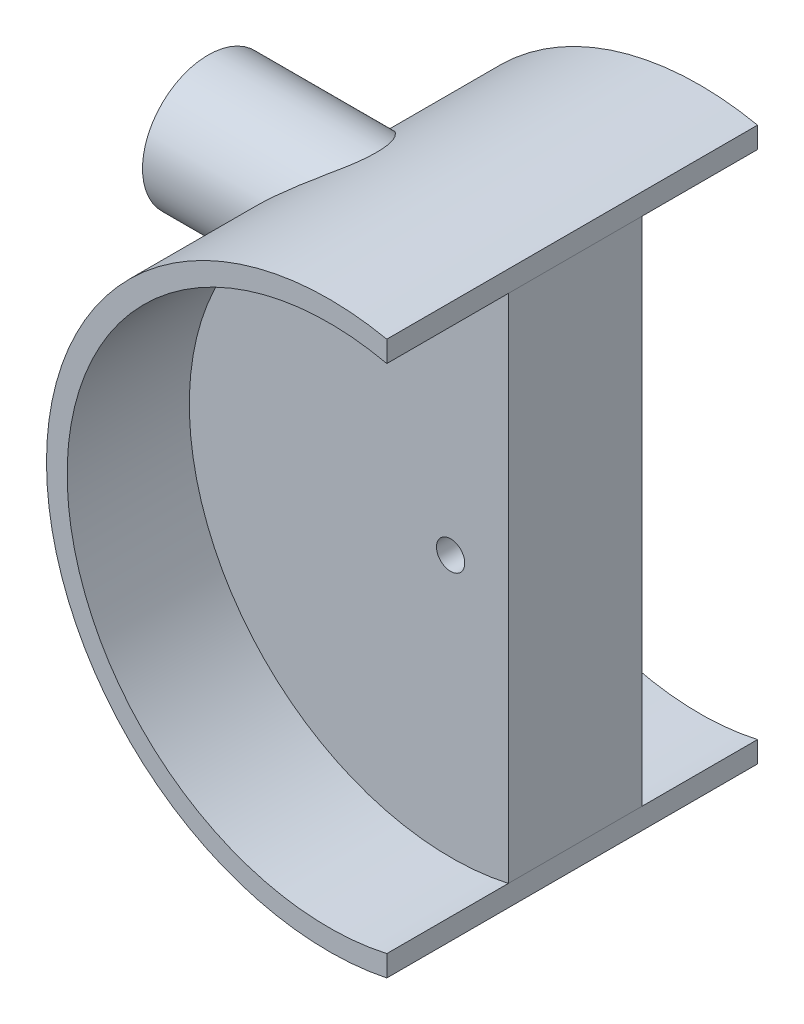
ISO-10303-21;
HEADER;
FILE_DESCRIPTION(('STEP AP214'),'2;1');
FILE_NAME('part.step','',(''),(''),'','','');
FILE_SCHEMA(('AUTOMOTIVE_DESIGN { 1 0 10303 214 1 1 1 1 }'));
ENDSEC;
DATA;
#1=APPLICATION_CONTEXT('core data for automotive mechanical design processes');
#2=APPLICATION_PROTOCOL_DEFINITION('international standard','automotive_design',2000,#1);
#3=PRODUCT_CONTEXT('',#1,'mechanical');
#4=PRODUCT('Part','Part','',(#3));
#5=PRODUCT_RELATED_PRODUCT_CATEGORY('part','',(#4));
#6=PRODUCT_DEFINITION_FORMATION('','',#4);
#7=PRODUCT_DEFINITION_CONTEXT('part definition',#1,'design');
#8=PRODUCT_DEFINITION('design','',#6,#7);
#9=PRODUCT_DEFINITION_SHAPE('','',#8);
#10=(LENGTH_UNIT() NAMED_UNIT(*) SI_UNIT(.MILLI.,.METRE.));
#11=(NAMED_UNIT(*) PLANE_ANGLE_UNIT() SI_UNIT($,.RADIAN.));
#12=(NAMED_UNIT(*) SI_UNIT($,.STERADIAN.) SOLID_ANGLE_UNIT());
#13=UNCERTAINTY_MEASURE_WITH_UNIT(LENGTH_MEASURE(1.E-05),#10,'distance_accuracy_value','');
#14=(GEOMETRIC_REPRESENTATION_CONTEXT(3) GLOBAL_UNCERTAINTY_ASSIGNED_CONTEXT((#13)) GLOBAL_UNIT_ASSIGNED_CONTEXT((#10,
#11,#12)) REPRESENTATION_CONTEXT('',''));
#15=CARTESIAN_POINT('',(0.,0.,0.));
#16=DIRECTION('',(0.,0.,1.));
#17=DIRECTION('',(1.,0.,0.));
#18=AXIS2_PLACEMENT_3D('',#15,#16,#17);
#19=CARTESIAN_POINT('',(-32.3215,18.7447089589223,19.05));
#20=DIRECTION('',(1.,0.,0.));
#21=DIRECTION('',(0.,0.,-1.));
#22=AXIS2_PLACEMENT_3D('',#19,#20,#21);
#23=CYLINDRICAL_SURFACE('',#22,6.858);
#24=CARTESIAN_POINT('',(-32.3215,18.7447089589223,19.05));
#25=DIRECTION('',(1.,0.,0.));
#26=DIRECTION('',(0.,0.,-1.));
#27=AXIS2_PLACEMENT_3D('',#24,#25,#26);
#28=CIRCLE('',#27,6.858);
#29=CARTESIAN_POINT('',(-32.3215,18.7447089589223,12.192));
#30=VERTEX_POINT('',#29);
#31=EDGE_CURVE('E12',#30,#30,#28,.T.);
#32=CARTESIAN_POINT('',(6.03249999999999,18.7447089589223,19.05));
#33=DIRECTION('',(1.,0.,0.));
#34=DIRECTION('',(0.,0.,-1.));
#35=AXIS2_PLACEMENT_3D('',#32,#33,#34);
#36=CIRCLE('',#35,6.858);
#37=CARTESIAN_POINT('',(6.03249999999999,18.7447089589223,12.192));
#38=VERTEX_POINT('',#37);
#39=EDGE_CURVE('E47',#38,#38,#36,.T.);
#40=CARTESIAN_POINT('',(-32.3215,18.7447089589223,12.192));
#41=CARTESIAN_POINT('',(-31.9219791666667,18.7447089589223,12.192));
#42=CARTESIAN_POINT('',(-31.5224583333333,18.7447089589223,12.192));
#43=CARTESIAN_POINT('',(-30.7234166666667,18.7447089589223,12.192));
#44=CARTESIAN_POINT('',(-30.3238958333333,18.7447089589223,12.192));
#45=CARTESIAN_POINT('',(-29.5248541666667,18.7447089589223,12.192));
#46=CARTESIAN_POINT('',(-29.1253333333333,18.7447089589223,12.192));
#47=CARTESIAN_POINT('',(-28.3262916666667,18.7447089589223,12.192));
#48=CARTESIAN_POINT('',(-27.9267708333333,18.7447089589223,12.192));
#49=CARTESIAN_POINT('',(-27.1277291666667,18.7447089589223,12.192));
#50=CARTESIAN_POINT('',(-26.7282083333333,18.7447089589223,12.192));
#51=CARTESIAN_POINT('',(-25.9291666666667,18.7447089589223,12.192));
#52=CARTESIAN_POINT('',(-25.5296458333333,18.7447089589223,12.192));
#53=CARTESIAN_POINT('',(-24.7306041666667,18.7447089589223,12.192));
#54=CARTESIAN_POINT('',(-24.3310833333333,18.7447089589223,12.192));
#55=CARTESIAN_POINT('',(-23.5320416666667,18.7447089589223,12.192));
#56=CARTESIAN_POINT('',(-23.1325208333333,18.7447089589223,12.192));
#57=CARTESIAN_POINT('',(-22.3334791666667,18.7447089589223,12.192));
#58=CARTESIAN_POINT('',(-21.9339583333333,18.7447089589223,12.192));
#59=CARTESIAN_POINT('',(-21.1349166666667,18.7447089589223,12.192));
#60=CARTESIAN_POINT('',(-20.7353958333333,18.7447089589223,12.192));
#61=CARTESIAN_POINT('',(-19.9363541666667,18.7447089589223,12.192));
#62=CARTESIAN_POINT('',(-19.5368333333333,18.7447089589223,12.192));
#63=CARTESIAN_POINT('',(-18.7377916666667,18.7447089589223,12.192));
#64=CARTESIAN_POINT('',(-18.3382708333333,18.7447089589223,12.192));
#65=CARTESIAN_POINT('',(-17.5392291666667,18.7447089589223,12.192));
#66=CARTESIAN_POINT('',(-17.1397083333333,18.7447089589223,12.192));
#67=CARTESIAN_POINT('',(-16.3406666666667,18.7447089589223,12.192));
#68=CARTESIAN_POINT('',(-15.9411458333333,18.7447089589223,12.192));
#69=CARTESIAN_POINT('',(-15.1421041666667,18.7447089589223,12.192));
#70=CARTESIAN_POINT('',(-14.7425833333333,18.7447089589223,12.192));
#71=CARTESIAN_POINT('',(-13.9435416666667,18.7447089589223,12.192));
#72=CARTESIAN_POINT('',(-13.5440208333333,18.7447089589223,12.192));
#73=CARTESIAN_POINT('',(-12.7449791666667,18.7447089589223,12.192));
#74=CARTESIAN_POINT('',(-12.3454583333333,18.7447089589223,12.192));
#75=CARTESIAN_POINT('',(-11.5464166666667,18.7447089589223,12.192));
#76=CARTESIAN_POINT('',(-11.1468958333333,18.7447089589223,12.192));
#77=CARTESIAN_POINT('',(-10.3478541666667,18.7447089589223,12.192));
#78=CARTESIAN_POINT('',(-9.94833333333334,18.7447089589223,12.192));
#79=CARTESIAN_POINT('',(-9.14929166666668,18.7447089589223,12.192));
#80=CARTESIAN_POINT('',(-8.74977083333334,18.7447089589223,12.192));
#81=CARTESIAN_POINT('',(-7.95072916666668,18.7447089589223,12.192));
#82=CARTESIAN_POINT('',(-7.55120833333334,18.7447089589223,12.192));
#83=CARTESIAN_POINT('',(-6.75216666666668,18.7447089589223,12.192));
#84=CARTESIAN_POINT('',(-6.35264583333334,18.7447089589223,12.192));
#85=CARTESIAN_POINT('',(-5.55360416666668,18.7447089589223,12.192));
#86=CARTESIAN_POINT('',(-5.15408333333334,18.7447089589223,12.192));
#87=CARTESIAN_POINT('',(-4.35504166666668,18.7447089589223,12.192));
#88=CARTESIAN_POINT('',(-3.95552083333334,18.7447089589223,12.192));
#89=CARTESIAN_POINT('',(-3.15647916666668,18.7447089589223,12.192));
#90=CARTESIAN_POINT('',(-2.75695833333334,18.7447089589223,12.192));
#91=CARTESIAN_POINT('',(-1.95791666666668,18.7447089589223,12.192));
#92=CARTESIAN_POINT('',(-1.55839583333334,18.7447089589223,12.192));
#93=CARTESIAN_POINT('',(-0.759354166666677,18.7447089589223,12.192));
#94=CARTESIAN_POINT('',(-0.359833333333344,18.7447089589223,12.192));
#95=CARTESIAN_POINT('',(0.439208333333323,18.7447089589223,12.192));
#96=CARTESIAN_POINT('',(0.838729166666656,18.7447089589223,12.192));
#97=CARTESIAN_POINT('',(1.63777083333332,18.7447089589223,12.192));
#98=CARTESIAN_POINT('',(2.03729166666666,18.7447089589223,12.192));
#99=CARTESIAN_POINT('',(2.83633333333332,18.7447089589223,12.192));
#100=CARTESIAN_POINT('',(3.23585416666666,18.7447089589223,12.192));
#101=CARTESIAN_POINT('',(4.03489583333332,18.7447089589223,12.192));
#102=CARTESIAN_POINT('',(4.43441666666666,18.7447089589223,12.192));
#103=CARTESIAN_POINT('',(5.23345833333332,18.7447089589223,12.192));
#104=CARTESIAN_POINT('',(5.63297916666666,18.7447089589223,12.192));
#105=CARTESIAN_POINT('',(6.03249999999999,18.7447089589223,12.192));
#106=B_SPLINE_CURVE_WITH_KNOTS('',3,(#40,#41,#42,#43,#44,#45,#46,#47,#48,#49,#50,#51,#52,#53,
#54,#55,#56,#57,#58,#59,#60,#61,#62,#63,#64,#65,#66,#67,#68,#69,#70,#71,#72,#73,#74,#75,#76,#77,
#78,#79,#80,#81,#82,#83,#84,#85,#86,#87,#88,#89,#90,#91,#92,#93,#94,#95,#96,#97,#98,#99,#100,
#101,#102,#103,#104,#105),.UNSPECIFIED.,.F.,.F.,(4,2,2,2,2,2,2,2,2,2,2,2,2,2,2,2,2,2,2,2,2,2,2,
2,2,2,2,2,2,2,2,2,4),(0.,1.1985625,2.397125,3.5956875,4.79425,5.9928125,7.191375,
8.38993749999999,9.58849999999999,10.7870625,11.985625,13.1841875,14.38275,15.5813125,16.779875,
17.9784375,19.177,20.3755625,21.574125,22.7726875,23.97125,25.1698125,26.368375,27.5669375,
28.7655,29.9640625,31.162625,32.3611875,33.55975,34.7583125,35.956875,37.1554375,38.354),.UNSPECIFIED.);
#107=EDGE_CURVE('BSEAM44',#30,#38,#106,.T.);
#108=ORIENTED_EDGE('',*,*,#31,.T.);
#109=ORIENTED_EDGE('',*,*,#39,.F.);
#110=ORIENTED_EDGE('',*,*,#107,.T.);
#111=ORIENTED_EDGE('',*,*,#107,.F.);
#112=EDGE_LOOP('',(#108,#110,#109,#111));
#113=FACE_BOUND('',#112,.T.);
#114=ADVANCED_FACE('F44',(#113),#23,.T.);
#115=CARTESIAN_POINT('',(-32.3215,18.7447089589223,19.05));
#116=DIRECTION('',(1.,0.,0.));
#117=DIRECTION('',(0.,0.,-1.));
#118=AXIS2_PLACEMENT_3D('',#115,#116,#117);
#119=PLANE('',#118);
#120=CARTESIAN_POINT('',(-32.3215,18.7447089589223,19.05));
#121=DIRECTION('',(-1.,0.,0.));
#122=DIRECTION('',(0.,0.,1.));
#123=AXIS2_PLACEMENT_3D('',#120,#121,#122);
#124=CIRCLE('',#123,3.4925);
#125=CARTESIAN_POINT('',(-32.3215,18.7447089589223,22.5425));
#126=VERTEX_POINT('',#125);
#127=EDGE_CURVE('E56',#126,#126,#124,.T.);
#128=ORIENTED_EDGE('',*,*,#127,.F.);
#129=EDGE_LOOP('',(#128));
#130=FACE_BOUND('',#129,.T.);
#131=ORIENTED_EDGE('',*,*,#31,.F.);
#132=EDGE_LOOP('',(#131));
#133=FACE_BOUND('',#132,.T.);
#134=ADVANCED_FACE('F71',(#130,#133),#119,.F.);
#135=CARTESIAN_POINT('',(6.03249999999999,18.7447089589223,19.05));
#136=DIRECTION('',(1.,0.,0.));
#137=DIRECTION('',(0.,0.,-1.));
#138=AXIS2_PLACEMENT_3D('',#135,#136,#137);
#139=PLANE('',#138);
#140=ORIENTED_EDGE('',*,*,#39,.T.);
#141=EDGE_LOOP('',(#140));
#142=FACE_BOUND('',#141,.T.);
#143=ADVANCED_FACE('F67',(#142),#139,.T.);
#144=CARTESIAN_POINT('',(-13.0175,18.7447089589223,19.05));
#145=DIRECTION('',(-1.,0.,0.));
#146=DIRECTION('',(0.,0.,1.));
#147=AXIS2_PLACEMENT_3D('',#144,#145,#146);
#148=CYLINDRICAL_SURFACE('',#147,3.4925);
#149=CARTESIAN_POINT('',(-13.0175,18.7447089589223,19.05));
#150=DIRECTION('',(-1.,0.,0.));
#151=DIRECTION('',(0.,0.,1.));
#152=AXIS2_PLACEMENT_3D('',#149,#150,#151);
#153=CIRCLE('',#152,3.4925);
#154=CARTESIAN_POINT('',(-13.0175,18.7447089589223,22.5425));
#155=VERTEX_POINT('',#154);
#156=EDGE_CURVE('E54',#155,#155,#153,.T.);
#157=ORIENTED_EDGE('',*,*,#156,.F.);
#158=EDGE_LOOP('',(#157));
#159=FACE_BOUND('',#158,.T.);
#160=ORIENTED_EDGE('',*,*,#127,.T.);
#161=EDGE_LOOP('',(#160));
#162=FACE_BOUND('',#161,.T.);
#163=ADVANCED_FACE('F64',(#159,#162),#148,.F.);
#164=CARTESIAN_POINT('',(-13.0175,18.7447089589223,19.05));
#165=DIRECTION('',(-1.,0.,0.));
#166=DIRECTION('',(0.,0.,1.));
#167=AXIS2_PLACEMENT_3D('',#164,#165,#166);
#168=PLANE('',#167);
#169=ORIENTED_EDGE('',*,*,#156,.T.);
#170=EDGE_LOOP('',(#169));
#171=FACE_BOUND('',#170,.T.);
#172=ADVANCED_FACE('F62',(#171),#168,.T.);
#173=CLOSED_SHELL('',(#114,#134,#143,#163,#172));
#174=MANIFOLD_SOLID_BREP('B2',#173);
#175=CARTESIAN_POINT('',(0.,0.,12.065));
#176=DIRECTION('',(0.,0.,-1.));
#177=DIRECTION('',(-1.,0.,0.));
#178=AXIS2_PLACEMENT_3D('',#175,#176,#177);
#179=PLANE('',#178);
#180=CARTESIAN_POINT('',(0.,0.,12.065));
#181=DIRECTION('',(0.,0.,-1.));
#182=DIRECTION('',(-1.,0.,0.));
#183=AXIS2_PLACEMENT_3D('',#180,#181,#182);
#184=CIRCLE('',#183,1.47623246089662);
#185=CARTESIAN_POINT('',(-1.47623246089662,0.,12.065));
#186=VERTEX_POINT('',#185);
#187=EDGE_CURVE('E164',#186,#186,#184,.T.);
#188=ORIENTED_EDGE('',*,*,#187,.F.);
#189=EDGE_LOOP('',(#188));
#190=FACE_BOUND('',#189,.T.);
#191=DIRECTION('',(0.,1.,0.));
#192=VECTOR('',#191,1.);
#193=CARTESIAN_POINT('',(6.03249999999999,26.6953879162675,12.065));
#194=LINE('',#193,#192);
#195=CARTESIAN_POINT('',(6.03249999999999,-26.6953879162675,12.065));
#196=VERTEX_POINT('',#195);
#197=CARTESIAN_POINT('',(6.03249999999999,26.6953879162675,12.065));
#198=VERTEX_POINT('',#197);
#199=EDGE_CURVE('E152',#196,#198,#194,.T.);
#200=ORIENTED_EDGE('',*,*,#199,.F.);
#201=CARTESIAN_POINT('',(0.0540186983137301,0.,12.065));
#202=DIRECTION('',(0.,0.,1.));
#203=DIRECTION('',(1.,0.,0.));
#204=AXIS2_PLACEMENT_3D('',#201,#202,#203);
#205=CIRCLE('',#204,27.3566440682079);
#206=EDGE_CURVE('E136',#198,#196,#205,.T.);
#207=ORIENTED_EDGE('',*,*,#206,.F.);
#208=EDGE_LOOP('',(#200,#207));
#209=FACE_BOUND('',#208,.T.);
#210=ADVANCED_FACE('F123',(#190,#209),#179,.T.);
#211=CARTESIAN_POINT('',(0.,0.,26.035));
#212=DIRECTION('',(0.,0.,-1.));
#213=DIRECTION('',(-1.,0.,0.));
#214=AXIS2_PLACEMENT_3D('',#211,#212,#213);
#215=PLANE('',#214);
#216=CARTESIAN_POINT('',(0.,0.,26.035));
#217=DIRECTION('',(0.,0.,1.));
#218=DIRECTION('',(1.,0.,0.));
#219=AXIS2_PLACEMENT_3D('',#216,#217,#218);
#220=CIRCLE('',#219,1.47623246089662);
#221=CARTESIAN_POINT('',(1.47623246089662,0.,26.035));
#222=VERTEX_POINT('',#221);
#223=EDGE_CURVE('E167',#222,#222,#220,.T.);
#224=ORIENTED_EDGE('',*,*,#223,.F.);
#225=EDGE_LOOP('',(#224));
#226=FACE_BOUND('',#225,.T.);
#227=DIRECTION('',(0.,1.,0.));
#228=VECTOR('',#227,1.);
#229=CARTESIAN_POINT('',(6.03249999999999,26.6953879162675,26.035));
#230=LINE('',#229,#228);
#231=CARTESIAN_POINT('',(6.03249999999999,-26.6953879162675,26.035));
#232=VERTEX_POINT('',#231);
#233=CARTESIAN_POINT('',(6.03249999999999,26.6953879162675,26.035));
#234=VERTEX_POINT('',#233);
#235=EDGE_CURVE('E145',#232,#234,#230,.T.);
#236=ORIENTED_EDGE('',*,*,#235,.T.);
#237=CARTESIAN_POINT('',(0.0540186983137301,0.,26.035));
#238=DIRECTION('',(0.,0.,1.));
#239=DIRECTION('',(1.,0.,0.));
#240=AXIS2_PLACEMENT_3D('',#237,#238,#239);
#241=CIRCLE('',#240,27.3566440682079);
#242=EDGE_CURVE('E42',#234,#232,#241,.T.);
#243=ORIENTED_EDGE('',*,*,#242,.T.);
#244=EDGE_LOOP('',(#236,#243));
#245=FACE_BOUND('',#244,.T.);
#246=ADVANCED_FACE('F210',(#226,#245),#215,.F.);
#247=CARTESIAN_POINT('',(6.03249999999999,26.6953879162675,26.035));
#248=DIRECTION('',(-1.,0.,0.));
#249=DIRECTION('',(0.,0.,1.));
#250=AXIS2_PLACEMENT_3D('',#247,#248,#249);
#251=PLANE('',#250);
#252=ORIENTED_EDGE('',*,*,#199,.T.);
#253=DIRECTION('',(0.,0.,-1.));
#254=VECTOR('',#253,1.);
#255=CARTESIAN_POINT('',(6.03249999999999,26.6953879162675,26.035));
#256=LINE('',#255,#254);
#257=EDGE_CURVE('E159',#234,#198,#256,.T.);
#258=ORIENTED_EDGE('',*,*,#257,.F.);
#259=ORIENTED_EDGE('',*,*,#235,.F.);
#260=DIRECTION('',(0.,0.,-1.));
#261=VECTOR('',#260,1.);
#262=CARTESIAN_POINT('',(6.03249999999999,-26.6953879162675,26.035));
#263=LINE('',#262,#261);
#264=EDGE_CURVE('E158',#232,#196,#263,.T.);
#265=ORIENTED_EDGE('',*,*,#264,.T.);
#266=EDGE_LOOP('',(#252,#258,#259,#265));
#267=FACE_BOUND('',#266,.T.);
#268=ADVANCED_FACE('F162',(#267),#251,.F.);
#269=CARTESIAN_POINT('',(0.0540186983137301,0.,26.035));
#270=DIRECTION('',(0.,0.,-1.));
#271=DIRECTION('',(-1.,0.,0.));
#272=AXIS2_PLACEMENT_3D('',#269,#270,#271);
#273=CYLINDRICAL_SURFACE('',#272,27.3566440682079);
#274=CARTESIAN_POINT('',(-19.8713887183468,18.7447089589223,22.5425));
#275=CARTESIAN_POINT('',(-20.073689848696,18.5296579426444,22.5425032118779));
#276=CARTESIAN_POINT('',(-20.272640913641,18.3111595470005,22.5226804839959));
#277=CARTESIAN_POINT('',(-20.6595476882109,17.8723138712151,22.4391511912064));
#278=CARTESIAN_POINT('',(-20.8474995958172,17.6519659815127,22.3754295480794));
#279=CARTESIAN_POINT('',(-21.1748921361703,17.2561036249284,22.2152278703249));
#280=CARTESIAN_POINT('',(-21.3169955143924,17.0796216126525,22.1266491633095));
#281=CARTESIAN_POINT('',(-21.5865574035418,16.7367501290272,21.9146433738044));
#282=CARTESIAN_POINT('',(-21.7140367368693,16.5703464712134,21.7912667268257));
#283=CARTESIAN_POINT('',(-21.9297606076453,16.2826896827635,21.5332489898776));
#284=CARTESIAN_POINT('',(-22.0209733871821,16.1586160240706,21.4042931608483));
#285=CARTESIAN_POINT('',(-22.1461839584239,15.9856837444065,21.1932775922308));
#286=CARTESIAN_POINT('',(-22.186002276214,15.93021269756,21.1199695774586));
#287=CARTESIAN_POINT('',(-22.2614362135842,15.8243691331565,20.9677465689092));
#288=CARTESIAN_POINT('',(-22.2970536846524,15.7739943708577,20.8888340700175));
#289=CARTESIAN_POINT('',(-22.3640222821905,15.6786746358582,20.7251221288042));
#290=CARTESIAN_POINT('',(-22.3953374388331,15.6337757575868,20.6402810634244));
#291=CARTESIAN_POINT('',(-22.4530252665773,15.5506111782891,20.4658475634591));
#292=CARTESIAN_POINT('',(-22.4794004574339,15.5123420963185,20.3762575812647));
#293=CARTESIAN_POINT('',(-22.5269204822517,15.4430866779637,20.192995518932));
#294=CARTESIAN_POINT('',(-22.5480669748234,15.4120980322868,20.0993247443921));
#295=CARTESIAN_POINT('',(-22.5848819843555,15.3579694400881,19.908698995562));
#296=CARTESIAN_POINT('',(-22.6005513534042,15.3348282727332,19.8117445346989));
#297=CARTESIAN_POINT('',(-22.6245548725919,15.2993029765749,19.6281942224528));
#298=CARTESIAN_POINT('',(-22.6335756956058,15.285914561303,19.5418808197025));
#299=CARTESIAN_POINT('',(-22.6472313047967,15.2656271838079,19.368118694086));
#300=CARTESIAN_POINT('',(-22.6518646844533,15.2587303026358,19.280669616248));
#301=CARTESIAN_POINT('',(-22.6566885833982,15.2515497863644,19.1054425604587));
#302=CARTESIAN_POINT('',(-22.6568826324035,15.2512608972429,19.0176648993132));
#303=CARTESIAN_POINT('',(-22.6528402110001,15.2572781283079,18.8424290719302));
#304=CARTESIAN_POINT('',(-22.6486021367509,15.2635866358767,18.7549710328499));
#305=CARTESIAN_POINT('',(-22.6301432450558,15.2910204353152,18.505818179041));
#306=CARTESIAN_POINT('',(-22.6104594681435,15.3202404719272,18.3453154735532));
#307=CARTESIAN_POINT('',(-22.5564429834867,15.3998461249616,18.0323667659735));
#308=CARTESIAN_POINT('',(-22.5221102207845,15.4502318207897,17.8799207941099));
#309=CARTESIAN_POINT('',(-22.4387482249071,15.5713498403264,17.5824026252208));
#310=CARTESIAN_POINT('',(-22.389337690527,15.6426078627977,17.4376523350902));
#311=CARTESIAN_POINT('',(-22.2776849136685,15.8015951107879,17.1629761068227));
#312=CARTESIAN_POINT('',(-22.2154388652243,15.8893292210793,17.0330545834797));
#313=CARTESIAN_POINT('',(-22.0725134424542,16.0878522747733,16.7767544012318));
#314=CARTESIAN_POINT('',(-21.9905797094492,16.200099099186,16.6522100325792));
#315=CARTESIAN_POINT('',(-21.8151263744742,16.436184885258,16.4241144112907));
#316=CARTESIAN_POINT('',(-21.7215992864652,16.5600313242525,16.3205768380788));
#317=CARTESIAN_POINT('',(-21.4819700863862,16.8712921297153,16.0937540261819));
#318=CARTESIAN_POINT('',(-21.3307332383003,17.0628658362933,15.9815624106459));
#319=CARTESIAN_POINT('',(-21.0133539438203,17.453232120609,15.7978684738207));
#320=CARTESIAN_POINT('',(-20.8471832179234,17.6520379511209,15.7264453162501));
#321=CARTESIAN_POINT('',(-20.5660761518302,17.9784903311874,15.6400383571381));
#322=CARTESIAN_POINT('',(-20.4542039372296,18.1060176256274,15.6139948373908));
#323=CARTESIAN_POINT('',(-20.227017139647,18.360135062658,15.5763631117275));
#324=CARTESIAN_POINT('',(-20.1117027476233,18.4867252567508,15.5647741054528));
#325=CARTESIAN_POINT('',(-19.8783753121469,18.7380653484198,15.5552404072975));
#326=CARTESIAN_POINT('',(-19.7603601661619,18.8628136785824,15.5573067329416));
#327=CARTESIAN_POINT('',(-19.5224743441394,19.1095856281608,15.5744112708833));
#328=CARTESIAN_POINT('',(-19.402603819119,19.2316094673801,15.589448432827));
#329=CARTESIAN_POINT('',(-19.1598725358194,19.47414296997,15.6322698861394));
#330=CARTESIAN_POINT('',(-19.0369940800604,19.5946009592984,15.6602455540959));
#331=CARTESIAN_POINT('',(-18.7907940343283,19.8314949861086,15.7286067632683));
#332=CARTESIAN_POINT('',(-18.6674724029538,19.947930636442,15.7689934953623));
#333=CARTESIAN_POINT('',(-18.4212099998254,20.1762258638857,15.8619743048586));
#334=CARTESIAN_POINT('',(-18.2982692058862,20.2880857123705,15.9145676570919));
#335=CARTESIAN_POINT('',(-18.05369342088,20.5066724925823,16.0319820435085));
#336=CARTESIAN_POINT('',(-17.9320581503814,20.6134005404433,16.0968004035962));
#337=CARTESIAN_POINT('',(-17.7162490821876,20.7995056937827,16.2241728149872));
#338=CARTESIAN_POINT('',(-17.6216224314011,20.879956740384,16.2843970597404));
#339=CARTESIAN_POINT('',(-17.4345761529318,21.0368705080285,16.4129858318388));
#340=CARTESIAN_POINT('',(-17.342156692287,21.1133329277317,16.4813509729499));
#341=CARTESIAN_POINT('',(-17.1605609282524,21.2616542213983,16.6265113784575));
#342=CARTESIAN_POINT('',(-17.071380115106,21.3335196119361,16.7032942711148));
#343=CARTESIAN_POINT('',(-16.897352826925,21.4720597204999,16.8658500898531));
#344=CARTESIAN_POINT('',(-16.8125043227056,21.5387368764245,16.9516187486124));
#345=CARTESIAN_POINT('',(-16.6267362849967,21.6830722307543,17.1570401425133));
#346=CARTESIAN_POINT('',(-16.5275807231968,21.7589038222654,17.2796230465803));
#347=CARTESIAN_POINT('',(-16.3433592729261,21.8980652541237,17.5414231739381));
#348=CARTESIAN_POINT('',(-16.2582724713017,21.9614136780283,17.680615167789));
#349=CARTESIAN_POINT('',(-16.1263650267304,22.0587001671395,17.9411564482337));
#350=CARTESIAN_POINT('',(-16.0752504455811,22.0960513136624,18.0590205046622));
#351=CARTESIAN_POINT('',(-15.9889125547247,22.1588175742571,18.3034817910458));
#352=CARTESIAN_POINT('',(-15.9536719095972,22.1842457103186,18.4300693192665));
#353=CARTESIAN_POINT('',(-15.9023949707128,22.2211586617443,18.6904629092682));
#354=CARTESIAN_POINT('',(-15.8865431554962,22.2325095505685,18.8243258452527));
#355=CARTESIAN_POINT('',(-15.8767540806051,22.2395257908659,19.0932489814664));
#356=CARTESIAN_POINT('',(-15.8828061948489,22.2351987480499,19.2283085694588));
#357=CARTESIAN_POINT('',(-15.913651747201,22.2130531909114,19.4759862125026));
#358=CARTESIAN_POINT('',(-15.935755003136,22.1971707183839,19.5891373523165));
#359=CARTESIAN_POINT('',(-15.9936034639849,22.1553846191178,19.8099276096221));
#360=CARTESIAN_POINT('',(-16.0293560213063,22.1294755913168,19.9175637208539));
#361=CARTESIAN_POINT('',(-16.1309913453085,22.0553154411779,20.1735851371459));
#362=CARTESIAN_POINT('',(-16.2031743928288,22.002266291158,20.31806079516));
#363=CARTESIAN_POINT('',(-16.3642232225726,21.8823534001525,20.5911419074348));
#364=CARTESIAN_POINT('',(-16.4531305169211,21.8154552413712,20.7197065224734));
#365=CARTESIAN_POINT('',(-16.6211237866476,21.687189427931,20.9344919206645));
#366=CARTESIAN_POINT('',(-16.6979827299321,21.6279119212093,21.0237640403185));
#367=CARTESIAN_POINT('',(-16.8568174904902,21.5039470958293,21.1936481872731));
#368=CARTESIAN_POINT('',(-16.9387960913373,21.4392568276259,21.2742554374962));
#369=CARTESIAN_POINT('',(-17.1066541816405,21.3051367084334,21.4274242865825));
#370=CARTESIAN_POINT('',(-17.192540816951,21.2356980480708,21.4999702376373));
#371=CARTESIAN_POINT('',(-17.3670919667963,21.0927385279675,21.637303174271));
#372=CARTESIAN_POINT('',(-17.4557572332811,21.019216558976,21.7020880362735));
#373=CARTESIAN_POINT('',(-17.6733845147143,20.8363396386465,21.8503228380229));
#374=CARTESIAN_POINT('',(-17.8033850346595,20.7250906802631,21.9299285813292));
#375=CARTESIAN_POINT('',(-18.0657639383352,20.4960927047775,22.0746587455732));
#376=CARTESIAN_POINT('',(-18.1981434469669,20.3783405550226,22.1397761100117));
#377=CARTESIAN_POINT('',(-18.4637143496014,20.1373194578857,22.2556256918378));
#378=CARTESIAN_POINT('',(-18.596904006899,20.0140601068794,22.3063818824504));
#379=CARTESIAN_POINT('',(-18.8631644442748,19.7625828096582,22.3935292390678));
#380=CARTESIAN_POINT('',(-18.996235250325,19.6343674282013,22.429927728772));
#381=CARTESIAN_POINT('',(-19.2540009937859,19.3808456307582,22.4863931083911));
#382=CARTESIAN_POINT('',(-19.3787508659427,19.2557727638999,22.5072543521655));
#383=CARTESIAN_POINT('',(-19.6265350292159,19.0024530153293,22.5353070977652));
#384=CARTESIAN_POINT('',(-19.7495692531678,18.8742060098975,22.5424980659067));
#385=CARTESIAN_POINT('',(-19.8713887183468,18.7447089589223,22.5425));
#386=B_SPLINE_CURVE_WITH_KNOTS('',3,(#274,#275,#276,#277,#278,#279,#280,#281,#282,#283,#284,
#285,#286,#287,#288,#289,#290,#291,#292,#293,#294,#295,#296,#297,#298,#299,#300,#301,#302,#303,
#304,#305,#306,#307,#308,#309,#310,#311,#312,#313,#314,#315,#316,#317,#318,#319,#320,#321,#322,
#323,#324,#325,#326,#327,#328,#329,#330,#331,#332,#333,#334,#335,#336,#337,#338,#339,#340,#341,
#342,#343,#344,#345,#346,#347,#348,#349,#350,#351,#352,#353,#354,#355,#356,#357,#358,#359,#360,
#361,#362,#363,#364,#365,#366,#367,#368,#369,#370,#371,#372,#373,#374,#375,#376,#377,#378,#379,
#380,#381,#382,#383,#384,#385),.UNSPECIFIED.,.T.,.F.,(4,2,2,2,2,2,2,2,2,2,2,2,2,2,2,2,2,2,2,2,2,
2,2,2,2,2,2,2,2,2,2,2,2,2,2,2,2,2,2,2,2,2,2,2,2,2,2,2,2,2,2,2,2,2,2,4),(0.,0.885296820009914,
1.77089786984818,2.4980421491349,3.2241378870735,3.82402837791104,4.12426031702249,
4.42435943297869,4.72683199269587,5.0291498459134,5.33137167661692,5.63354646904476,
5.89663190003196,6.15980164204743,6.4227621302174,6.68581780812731,7.1763095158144,
7.66680306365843,8.17090445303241,8.6751555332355,9.2328401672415,9.79088680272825,
10.5924120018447,11.3954883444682,11.9097770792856,12.4240373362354,12.938712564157,
13.4533461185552,13.9758479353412,14.4983999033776,15.0209208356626,15.5433276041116,
15.9571482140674,16.3710000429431,16.7842515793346,17.1973077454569,17.7207370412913,
18.2433811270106,18.6432985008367,19.0427780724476,19.4460297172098,19.8490857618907,
20.1967447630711,20.5445913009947,21.0517190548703,21.5601225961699,21.9552217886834,
22.3505377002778,22.7466080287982,23.1427864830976,23.7081550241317,24.2737983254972,
24.8384917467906,25.4028967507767,25.9359742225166,26.4690725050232),.UNSPECIFIED.);
#387=CARTESIAN_POINT('',(-19.8713887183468,18.7447089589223,22.5425));
#388=VERTEX_POINT('',#387);
#389=EDGE_CURVE('E126',#388,#388,#386,.T.);
#390=ORIENTED_EDGE('',*,*,#389,.T.);
#391=EDGE_LOOP('',(#390));
#392=FACE_BOUND('',#391,.T.);
#393=ORIENTED_EDGE('',*,*,#206,.T.);
#394=ORIENTED_EDGE('',*,*,#264,.F.);
#395=ORIENTED_EDGE('',*,*,#242,.F.);
#396=ORIENTED_EDGE('',*,*,#257,.T.);
#397=EDGE_LOOP('',(#393,#394,#395,#396));
#398=FACE_BOUND('',#397,.T.);
#399=ADVANCED_FACE('F157',(#392,#398),#273,.T.);
#400=CARTESIAN_POINT('',(0.,0.,0.));
#401=DIRECTION('',(0.,0.,1.));
#402=DIRECTION('',(1.,0.,0.));
#403=AXIS2_PLACEMENT_3D('',#400,#401,#402);
#404=CYLINDRICAL_SURFACE('',#403,1.47623246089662);
#405=ORIENTED_EDGE('',*,*,#187,.T.);
#406=EDGE_LOOP('',(#405));
#407=FACE_BOUND('',#406,.T.);
#408=ORIENTED_EDGE('',*,*,#223,.T.);
#409=EDGE_LOOP('',(#408));
#410=FACE_BOUND('',#409,.T.);
#411=ADVANCED_FACE('F196',(#407,#410),#404,.F.);
#412=CARTESIAN_POINT('',(-13.0175,18.7447089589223,19.05));
#413=DIRECTION('',(-1.,0.,0.));
#414=DIRECTION('',(0.,0.,1.));
#415=AXIS2_PLACEMENT_3D('',#412,#413,#414);
#416=CYLINDRICAL_SURFACE('',#415,3.4925);
#417=CARTESIAN_POINT('',(-13.0175,18.7447089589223,19.05));
#418=DIRECTION('',(-1.,0.,0.));
#419=DIRECTION('',(0.,0.,1.));
#420=AXIS2_PLACEMENT_3D('',#417,#418,#419);
#421=CIRCLE('',#420,3.4925);
#422=CARTESIAN_POINT('',(-13.0175,18.7447089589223,22.5425));
#423=VERTEX_POINT('',#422);
#424=EDGE_CURVE('E185',#423,#423,#421,.T.);
#425=ORIENTED_EDGE('',*,*,#424,.F.);
#426=EDGE_LOOP('',(#425));
#427=FACE_BOUND('',#426,.T.);
#428=ORIENTED_EDGE('',*,*,#389,.F.);
#429=EDGE_LOOP('',(#428));
#430=FACE_BOUND('',#429,.T.);
#431=ADVANCED_FACE('F193',(#427,#430),#416,.F.);
#432=CARTESIAN_POINT('',(-13.0175,18.7447089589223,19.05));
#433=DIRECTION('',(-1.,0.,0.));
#434=DIRECTION('',(0.,0.,1.));
#435=AXIS2_PLACEMENT_3D('',#432,#433,#434);
#436=PLANE('',#435);
#437=ORIENTED_EDGE('',*,*,#424,.T.);
#438=EDGE_LOOP('',(#437));
#439=FACE_BOUND('',#438,.T.);
#440=ADVANCED_FACE('F195',(#439),#436,.T.);
#441=CLOSED_SHELL('',(#210,#246,#268,#399,#411,#431,#440));
#442=MANIFOLD_SOLID_BREP('B7',#441);
#443=CARTESIAN_POINT('',(6.03249999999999,28.9047089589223,38.735));
#444=DIRECTION('',(1.,0.,0.));
#445=DIRECTION('',(0.,0.,-1.));
#446=AXIS2_PLACEMENT_3D('',#443,#444,#445);
#447=PLANE('',#446);
#448=DIRECTION('',(0.,-1.,0.));
#449=VECTOR('',#448,1.);
#450=CARTESIAN_POINT('',(6.03249999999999,28.9047089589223,0.));
#451=LINE('',#450,#449);
#452=CARTESIAN_POINT('',(6.0325,28.9047089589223,0.));
#453=VERTEX_POINT('',#452);
#454=CARTESIAN_POINT('',(6.03249999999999,26.6953879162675,0.));
#455=VERTEX_POINT('',#454);
#456=EDGE_CURVE('E332',#453,#455,#451,.T.);
#457=ORIENTED_EDGE('',*,*,#456,.F.);
#458=DIRECTION('',(0.,0.,-1.));
#459=VECTOR('',#458,1.);
#460=CARTESIAN_POINT('',(6.0325,28.9047089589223,38.735));
#461=LINE('',#460,#459);
#462=CARTESIAN_POINT('',(6.0325,28.9047089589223,38.735));
#463=VERTEX_POINT('',#462);
#464=EDGE_CURVE('E121',#463,#453,#461,.T.);
#465=ORIENTED_EDGE('',*,*,#464,.F.);
#466=DIRECTION('',(0.,-1.,0.));
#467=VECTOR('',#466,1.);
#468=CARTESIAN_POINT('',(6.03249999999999,28.9047089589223,38.735));
#469=LINE('',#468,#467);
#470=CARTESIAN_POINT('',(6.03249999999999,26.6953879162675,38.735));
#471=VERTEX_POINT('',#470);
#472=EDGE_CURVE('E325',#463,#471,#469,.T.);
#473=ORIENTED_EDGE('',*,*,#472,.T.);
#474=DIRECTION('',(0.,0.,-1.));
#475=VECTOR('',#474,1.);
#476=CARTESIAN_POINT('',(6.03249999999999,26.6953879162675,38.735));
#477=LINE('',#476,#475);
#478=EDGE_CURVE('E307',#471,#455,#477,.T.);
#479=ORIENTED_EDGE('',*,*,#478,.T.);
#480=EDGE_LOOP('',(#457,#465,#473,#479));
#481=FACE_BOUND('',#480,.T.);
#482=ADVANCED_FACE('F261',(#481),#447,.T.);
#483=CARTESIAN_POINT('',(0.,0.,38.735));
#484=DIRECTION('',(0.,0.,-1.));
#485=DIRECTION('',(-1.,0.,0.));
#486=AXIS2_PLACEMENT_3D('',#483,#484,#485);
#487=CYLINDRICAL_SURFACE('',#486,29.5275);
#488=CARTESIAN_POINT('',(-22.8146694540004,18.7447089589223,22.5425));
#489=CARTESIAN_POINT('',(-23.0026953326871,18.5158501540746,22.5425022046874));
#490=CARTESIAN_POINT('',(-23.187440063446,18.2839195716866,22.5200361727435));
#491=CARTESIAN_POINT('',(-23.5454325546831,17.8205350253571,22.4262841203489));
#492=CARTESIAN_POINT('',(-23.718675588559,17.5890812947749,22.3549781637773));
#493=CARTESIAN_POINT('',(-24.0122730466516,17.185235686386,22.1809603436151));
#494=CARTESIAN_POINT('',(-24.1359573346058,17.0109061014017,22.0883907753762));
#495=CARTESIAN_POINT('',(-24.3695863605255,16.6744802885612,21.8698998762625));
#496=CARTESIAN_POINT('',(-24.4795510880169,16.5123664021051,21.7440279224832));
#497=CARTESIAN_POINT('',(-24.6673350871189,16.2302253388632,21.4803108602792));
#498=CARTESIAN_POINT('',(-24.7475027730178,16.10752564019,21.3470387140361));
#499=CARTESIAN_POINT('',(-24.8567856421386,15.9379428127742,21.130400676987));
#500=CARTESIAN_POINT('',(-24.8913993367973,15.8838034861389,21.0553590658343));
#501=CARTESIAN_POINT('',(-24.95670712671,15.7809925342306,20.9000273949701));
#502=CARTESIAN_POINT('',(-24.9874028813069,15.7323185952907,20.8197395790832));
#503=CARTESIAN_POINT('',(-25.0447984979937,15.6407885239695,20.65382939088));
#504=CARTESIAN_POINT('',(-25.0714721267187,15.5979707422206,20.568176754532));
#505=CARTESIAN_POINT('',(-25.1203368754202,15.5191521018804,20.3926064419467));
#506=CARTESIAN_POINT('',(-25.1425301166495,15.4831480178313,20.3026908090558));
#507=CARTESIAN_POINT('',(-25.1822290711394,15.4184965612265,20.1192625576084));
#508=CARTESIAN_POINT('',(-25.1997355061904,15.3898480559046,20.0257504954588));
#509=CARTESIAN_POINT('',(-25.2298845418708,15.3403723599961,19.835917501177));
#510=CARTESIAN_POINT('',(-25.2425277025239,15.3195442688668,19.7395968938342));
#511=CARTESIAN_POINT('',(-25.2617368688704,15.2878451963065,19.5554007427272));
#512=CARTESIAN_POINT('',(-25.2688067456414,15.2761499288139,19.4677184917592));
#513=CARTESIAN_POINT('',(-25.2789006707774,15.2594407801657,19.2914568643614));
#514=CARTESIAN_POINT('',(-25.281923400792,15.2544290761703,19.2028772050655));
#515=CARTESIAN_POINT('',(-25.2838892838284,15.2511706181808,19.0256063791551));
#516=CARTESIAN_POINT('',(-25.2828353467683,15.2529190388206,18.9369153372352));
#517=CARTESIAN_POINT('',(-25.2766683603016,15.2631359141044,18.7600536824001));
#518=CARTESIAN_POINT('',(-25.2715538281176,15.2716068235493,18.6718832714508));
#519=CARTESIAN_POINT('',(-25.2508683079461,15.3058049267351,18.4178450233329));
#520=CARTESIAN_POINT('',(-25.2300293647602,15.3402012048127,18.2534620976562));
#521=CARTESIAN_POINT('',(-25.1744342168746,15.4312640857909,17.9335984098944));
#522=CARTESIAN_POINT('',(-25.1396776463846,15.487931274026,17.7781178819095));
#523=CARTESIAN_POINT('',(-25.0560381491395,15.6228890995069,17.4751752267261));
#524=CARTESIAN_POINT('',(-25.0067731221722,15.7017616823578,17.3280787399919));
#525=CARTESIAN_POINT('',(-24.8959103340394,15.8769528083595,17.0498505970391));
#526=CARTESIAN_POINT('',(-24.8343088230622,15.9732766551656,16.918723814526));
#527=CARTESIAN_POINT('',(-24.6938386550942,16.1896797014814,16.6625080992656));
#528=CARTESIAN_POINT('',(-24.6138821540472,16.3111496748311,16.539195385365));
#529=CARTESIAN_POINT('',(-24.4429223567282,16.5662431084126,16.3149062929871));
#530=CARTESIAN_POINT('',(-24.3519138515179,16.6998722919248,16.2139405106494));
#531=CARTESIAN_POINT('',(-24.1463129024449,16.9960568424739,16.0208844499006));
#532=CARTESIAN_POINT('',(-24.0302328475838,17.15993766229,15.9324210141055));
#533=CARTESIAN_POINT('',(-23.7885320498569,17.4934712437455,15.7842195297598));
#534=CARTESIAN_POINT('',(-23.6629058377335,17.6631272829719,15.7244980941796));
#535=CARTESIAN_POINT('',(-23.3801027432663,18.0363116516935,15.6236651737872));
#536=CARTESIAN_POINT('',(-23.2214309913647,18.2402182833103,15.5881540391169));
#537=CARTESIAN_POINT('',(-22.8972005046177,18.6456171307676,15.5529729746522));
#538=CARTESIAN_POINT('',(-22.7316369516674,18.8471075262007,15.5533285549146));
#539=CARTESIAN_POINT('',(-22.3653804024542,19.2810233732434,15.5908347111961));
#540=CARTESIAN_POINT('',(-22.163902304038,19.5121968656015,15.6348459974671));
#541=CARTESIAN_POINT('',(-21.7603838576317,19.9612133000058,15.7678411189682));
#542=CARTESIAN_POINT('',(-21.5583431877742,20.1790453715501,15.8568610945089));
#543=CARTESIAN_POINT('',(-21.2676242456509,20.4836324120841,16.0192370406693));
#544=CARTESIAN_POINT('',(-21.1765823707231,20.5777117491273,16.0751417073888));
#545=CARTESIAN_POINT('',(-20.9964201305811,20.7615055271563,16.1965420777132));
#546=CARTESIAN_POINT('',(-20.9072999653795,20.8512195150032,16.2620387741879));
#547=CARTESIAN_POINT('',(-20.7320135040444,21.0255114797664,16.4027327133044));
#548=CARTESIAN_POINT('',(-20.6458434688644,21.1100960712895,16.4779170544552));
#549=CARTESIAN_POINT('',(-20.4774964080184,21.2734377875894,16.638323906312));
#550=CARTESIAN_POINT('',(-20.3953176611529,21.3521974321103,16.7235420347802));
#551=CARTESIAN_POINT('',(-20.2090389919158,21.5288078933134,16.9354388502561));
#552=CARTESIAN_POINT('',(-20.1070716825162,21.6239578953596,17.0663208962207));
#553=CARTESIAN_POINT('',(-19.9175639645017,21.7986349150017,17.3475346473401));
#554=CARTESIAN_POINT('',(-19.830001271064,21.8781861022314,17.4978356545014));
#555=CARTESIAN_POINT('',(-19.6925082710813,22.0019318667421,17.782480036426));
#556=CARTESIAN_POINT('',(-19.6385356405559,22.0500538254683,17.9131414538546));
#557=CARTESIAN_POINT('',(-19.5469799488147,22.1312588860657,18.1846674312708));
#558=CARTESIAN_POINT('',(-19.5093823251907,22.1643553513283,18.3255227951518));
#559=CARTESIAN_POINT('',(-19.4677373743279,22.2009185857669,18.5424067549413));
#560=CARTESIAN_POINT('',(-19.4562955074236,22.2109421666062,18.6160013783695));
#561=CARTESIAN_POINT('',(-19.4387503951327,22.2262993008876,18.7642952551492));
#562=CARTESIAN_POINT('',(-19.4326445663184,22.2316351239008,18.8389939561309));
#563=CARTESIAN_POINT('',(-19.4259587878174,22.2374774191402,18.988815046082));
#564=CARTESIAN_POINT('',(-19.4253778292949,22.2379847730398,19.0639373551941));
#565=CARTESIAN_POINT('',(-19.4297442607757,22.2341695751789,19.2138741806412));
#566=CARTESIAN_POINT('',(-19.4346912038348,22.2298474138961,19.2886887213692));
#567=CARTESIAN_POINT('',(-19.4556969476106,22.2114714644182,19.4927335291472));
#568=CARTESIAN_POINT('',(-19.4772857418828,22.1925688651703,19.6210201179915));
#569=CARTESIAN_POINT('',(-19.5351434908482,22.1416548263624,19.8714090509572));
#570=CARTESIAN_POINT('',(-19.571419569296,22.1096370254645,19.9935083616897));
#571=CARTESIAN_POINT('',(-19.6716086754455,22.0206037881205,20.2725244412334));
#572=CARTESIAN_POINT('',(-19.7407734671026,21.9587336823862,20.4260068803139));
#573=CARTESIAN_POINT('',(-19.8957036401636,21.8184602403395,20.7160480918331));
#574=CARTESIAN_POINT('',(-19.9815031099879,21.7400229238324,20.8525711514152));
#575=CARTESIAN_POINT('',(-20.2034329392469,21.5342945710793,21.1627022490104));
#576=CARTESIAN_POINT('',(-20.3455247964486,21.4003546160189,21.3276524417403));
#577=CARTESIAN_POINT('',(-20.5687773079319,21.1851259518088,21.5505240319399));
#578=CARTESIAN_POINT('',(-20.6450051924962,21.1108717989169,21.6208110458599));
#579=CARTESIAN_POINT('',(-20.8000636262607,20.9581107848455,21.7534483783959));
#580=CARTESIAN_POINT('',(-20.8788934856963,20.8796050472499,21.8158007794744));
#581=CARTESIAN_POINT('',(-21.0626279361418,20.6944610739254,21.9504840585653));
#582=CARTESIAN_POINT('',(-21.1681941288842,20.5865077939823,22.0201116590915));
#583=CARTESIAN_POINT('',(-21.3812621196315,20.3651319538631,22.1464561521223));
#584=CARTESIAN_POINT('',(-21.4887646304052,20.251707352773,22.2031681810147));
#585=CARTESIAN_POINT('',(-21.8122176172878,19.9047636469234,22.3538301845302));
#586=CARTESIAN_POINT('',(-22.0297293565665,19.6639578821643,22.4287470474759));
#587=CARTESIAN_POINT('',(-22.3412418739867,19.3070887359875,22.4987394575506));
#588=CARTESIAN_POINT('',(-22.4367561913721,19.1960110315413,22.5150496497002));
#589=CARTESIAN_POINT('',(-22.6266747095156,18.971779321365,22.5369310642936));
#590=CARTESIAN_POINT('',(-22.7210785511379,18.8586246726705,22.5424989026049));
#591=CARTESIAN_POINT('',(-22.8146694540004,18.7447089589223,22.5425));
#592=B_SPLINE_CURVE_WITH_KNOTS('',3,(#488,#489,#490,#491,#492,#493,#494,#495,#496,#497,#498,
#499,#500,#501,#502,#503,#504,#505,#506,#507,#508,#509,#510,#511,#512,#513,#514,#515,#516,#517,
#518,#519,#520,#521,#522,#523,#524,#525,#526,#527,#528,#529,#530,#531,#532,#533,#534,#535,#536,
#537,#538,#539,#540,#541,#542,#543,#544,#545,#546,#547,#548,#549,#550,#551,#552,#553,#554,#555,
#556,#557,#558,#559,#560,#561,#562,#563,#564,#565,#566,#567,#568,#569,#570,#571,#572,#573,#574,
#575,#576,#577,#578,#579,#580,#581,#582,#583,#584,#585,#586,#587,#588,#589,#590,#591),
.UNSPECIFIED.,.T.,.F.,(4,2,2,2,2,2,2,2,2,2,2,2,2,2,2,2,2,2,2,2,2,2,2,2,2,2,2,2,2,2,2,2,2,2,2,2,
2,2,2,2,2,2,2,2,2,2,2,2,2,2,2,4),(0.,0.888075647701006,1.77651401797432,2.47259626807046,
3.16765217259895,3.75922232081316,4.05529592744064,4.35124372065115,4.64904524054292,
4.9467054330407,5.24431975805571,5.54189980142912,5.80778264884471,6.07375208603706,
6.33953170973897,6.60540843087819,7.11055635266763,7.61571755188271,8.13559795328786,
8.65563661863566,9.22540076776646,9.79543450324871,10.4513189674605,11.1075820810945,
11.8870769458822,12.6671262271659,13.5928847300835,14.5193877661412,14.9461362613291,
15.3729289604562,15.7991590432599,16.2252036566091,16.7971751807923,17.3682533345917,
17.8146314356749,18.2606117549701,18.4857712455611,18.7108216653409,18.9358309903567,
19.1608221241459,19.5532716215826,19.9459116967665,20.4809645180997,21.0171256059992,
21.7795132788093,22.161880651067,22.5441474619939,23.0422719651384,23.5405837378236,
24.5343104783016,24.9762157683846,25.4182602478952),.UNSPECIFIED.);
#593=CARTESIAN_POINT('',(-22.8146694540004,18.7447089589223,22.5425));
#594=VERTEX_POINT('',#593);
#595=EDGE_CURVE('E336',#594,#594,#592,.T.);
#596=ORIENTED_EDGE('',*,*,#595,.T.);
#597=EDGE_LOOP('',(#596));
#598=FACE_BOUND('',#597,.T.);
#599=CARTESIAN_POINT('',(0.,0.,0.));
#600=DIRECTION('',(0.,0.,1.));
#601=DIRECTION('',(1.,0.,0.));
#602=AXIS2_PLACEMENT_3D('',#599,#600,#601);
#603=CIRCLE('',#602,29.5275);
#604=CARTESIAN_POINT('',(6.0325,-28.9047089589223,0.));
#605=VERTEX_POINT('',#604);
#606=EDGE_CURVE('E327',#453,#605,#603,.T.);
#607=ORIENTED_EDGE('',*,*,#606,.T.);
#608=DIRECTION('',(0.,0.,-1.));
#609=VECTOR('',#608,1.);
#610=CARTESIAN_POINT('',(6.0325,-28.9047089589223,38.735));
#611=LINE('',#610,#609);
#612=CARTESIAN_POINT('',(6.0325,-28.9047089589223,38.735));
#613=VERTEX_POINT('',#612);
#614=EDGE_CURVE('E273',#613,#605,#611,.T.);
#615=ORIENTED_EDGE('',*,*,#614,.F.);
#616=CARTESIAN_POINT('',(0.,0.,38.735));
#617=DIRECTION('',(0.,0.,1.));
#618=DIRECTION('',(1.,0.,0.));
#619=AXIS2_PLACEMENT_3D('',#616,#617,#618);
#620=CIRCLE('',#619,29.5275);
#621=EDGE_CURVE('E322',#463,#613,#620,.T.);
#622=ORIENTED_EDGE('',*,*,#621,.F.);
#623=ORIENTED_EDGE('',*,*,#464,.T.);
#624=EDGE_LOOP('',(#607,#615,#622,#623));
#625=FACE_BOUND('',#624,.T.);
#626=ADVANCED_FACE('F342',(#598,#625),#487,.T.);
#627=CARTESIAN_POINT('',(6.03249999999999,-26.6953879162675,38.735));
#628=DIRECTION('',(1.,0.,0.));
#629=DIRECTION('',(0.,0.,-1.));
#630=AXIS2_PLACEMENT_3D('',#627,#628,#629);
#631=PLANE('',#630);
#632=DIRECTION('',(0.,-1.,0.));
#633=VECTOR('',#632,1.);
#634=CARTESIAN_POINT('',(6.03249999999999,-26.6953879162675,0.));
#635=LINE('',#634,#633);
#636=CARTESIAN_POINT('',(6.03249999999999,-26.6953879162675,0.));
#637=VERTEX_POINT('',#636);
#638=EDGE_CURVE('E315',#637,#605,#635,.T.);
#639=ORIENTED_EDGE('',*,*,#638,.F.);
#640=DIRECTION('',(0.,0.,-1.));
#641=VECTOR('',#640,1.);
#642=CARTESIAN_POINT('',(6.03249999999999,-26.6953879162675,38.735));
#643=LINE('',#642,#641);
#644=CARTESIAN_POINT('',(6.03249999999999,-26.6953879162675,38.735));
#645=VERTEX_POINT('',#644);
#646=EDGE_CURVE('E310',#645,#637,#643,.T.);
#647=ORIENTED_EDGE('',*,*,#646,.F.);
#648=DIRECTION('',(0.,-1.,0.));
#649=VECTOR('',#648,1.);
#650=CARTESIAN_POINT('',(6.03249999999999,-26.6953879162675,38.735));
#651=LINE('',#650,#649);
#652=EDGE_CURVE('E313',#645,#613,#651,.T.);
#653=ORIENTED_EDGE('',*,*,#652,.T.);
#654=ORIENTED_EDGE('',*,*,#614,.T.);
#655=EDGE_LOOP('',(#639,#647,#653,#654));
#656=FACE_BOUND('',#655,.T.);
#657=ADVANCED_FACE('F312',(#656),#631,.T.);
#658=CARTESIAN_POINT('',(0.,0.,38.735));
#659=DIRECTION('',(0.,0.,-1.));
#660=DIRECTION('',(-1.,0.,0.));
#661=AXIS2_PLACEMENT_3D('',#658,#659,#660);
#662=CYLINDRICAL_SURFACE('',#661,27.3685);
#663=CARTESIAN_POINT('',(-19.9416819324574,18.7447089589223,22.5425));
#664=CARTESIAN_POINT('',(-20.1438984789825,18.5295722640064,22.5425032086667));
#665=CARTESIAN_POINT('',(-20.3427657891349,18.3109899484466,22.5226645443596));
#666=CARTESIAN_POINT('',(-20.729501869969,17.8719894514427,22.4390730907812));
#667=CARTESIAN_POINT('',(-20.9173667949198,17.6515706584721,22.3753050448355));
#668=CARTESIAN_POINT('',(-21.2445504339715,17.2556548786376,22.2150170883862));
#669=CARTESIAN_POINT('',(-21.3865362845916,17.0791852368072,22.1264126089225));
#670=CARTESIAN_POINT('',(-21.6558679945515,16.7363526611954,21.9143643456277));
#671=CARTESIAN_POINT('',(-21.7832346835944,16.5699755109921,21.7909710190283));
#672=CARTESIAN_POINT('',(-21.9987793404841,16.2823538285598,21.5329171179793));
#673=CARTESIAN_POINT('',(-22.0899216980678,16.1582891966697,21.4039347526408));
#674=CARTESIAN_POINT('',(-22.2150302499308,15.9853785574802,21.1928848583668));
#675=CARTESIAN_POINT('',(-22.2548151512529,15.9299160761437,21.1195663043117));
#676=CARTESIAN_POINT('',(-22.3301839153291,15.8240919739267,20.9673245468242));
#677=CARTESIAN_POINT('',(-22.3657696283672,15.7737281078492,20.8884038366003));
#678=CARTESIAN_POINT('',(-22.4326762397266,15.6784326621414,20.7246790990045));
#679=CARTESIAN_POINT('',(-22.4639612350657,15.6335471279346,20.6398335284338));
#680=CARTESIAN_POINT('',(-22.5215915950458,15.5504103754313,20.4653942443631));
#681=CARTESIAN_POINT('',(-22.5479394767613,15.5121557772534,20.3758029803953));
#682=CARTESIAN_POINT('',(-22.5954083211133,15.4429297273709,20.1925415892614));
#683=CARTESIAN_POINT('',(-22.6165309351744,15.411955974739,20.0988727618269));
#684=CARTESIAN_POINT('',(-22.6533021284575,15.3578568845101,19.9082540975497));
#685=CARTESIAN_POINT('',(-22.6689515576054,15.3347303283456,19.8113047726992));
#686=CARTESIAN_POINT('',(-22.6929237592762,15.2992287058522,19.6277524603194));
#687=CARTESIAN_POINT('',(-22.7019319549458,15.2858505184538,19.5414312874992));
#688=CARTESIAN_POINT('',(-22.7155644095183,15.2655846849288,19.3676551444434));
#689=CARTESIAN_POINT('',(-22.7201872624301,15.2586991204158,19.2801998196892));
#690=CARTESIAN_POINT('',(-22.7249923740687,15.2515420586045,19.1049616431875));
#691=CARTESIAN_POINT('',(-22.7251781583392,15.2512653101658,19.0171791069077));
#692=CARTESIAN_POINT('',(-22.7211215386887,15.2573074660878,18.841934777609));
#693=CARTESIAN_POINT('',(-22.7168775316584,15.2636287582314,18.7544731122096));
#694=CARTESIAN_POINT('',(-22.6984034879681,15.2911022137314,18.5052906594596));
#695=CARTESIAN_POINT('',(-22.6787114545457,15.3203526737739,18.3447637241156));
#696=CARTESIAN_POINT('',(-22.6246826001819,15.400025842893,18.0317715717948));
#697=CARTESIAN_POINT('',(-22.5903457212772,15.4504486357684,17.8793063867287));
#698=CARTESIAN_POINT('',(-22.5069783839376,15.5716488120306,17.5817526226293));
#699=CARTESIAN_POINT('',(-22.4575665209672,15.6429523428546,17.4369862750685));
#700=CARTESIAN_POINT('',(-22.3459137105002,15.8020365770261,17.1622847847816));
#701=CARTESIAN_POINT('',(-22.2836689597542,15.8898221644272,17.0323540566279));
#702=CARTESIAN_POINT('',(-22.1407523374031,16.0884532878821,16.7760497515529));
#703=CARTESIAN_POINT('',(-22.0588270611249,16.2007564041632,16.6515102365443));
#704=CARTESIAN_POINT('',(-21.8833934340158,16.4369583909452,16.4234323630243));
#705=CARTESIAN_POINT('',(-21.7898775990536,16.5608647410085,16.3199076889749));
#706=CARTESIAN_POINT('',(-21.5503152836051,16.872226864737,16.0931620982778));
#707=CARTESIAN_POINT('',(-21.3991404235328,17.0638391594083,15.9810283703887));
#708=CARTESIAN_POINT('',(-21.081895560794,17.4542829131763,15.7974507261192));
#709=CARTESIAN_POINT('',(-20.9157973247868,17.6531276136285,15.7260858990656));
#710=CARTESIAN_POINT('',(-20.6348520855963,17.9796023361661,15.6397897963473));
#711=CARTESIAN_POINT('',(-20.5230681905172,18.1071128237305,15.6137922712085));
#712=CARTESIAN_POINT('',(-20.2960632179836,18.3611978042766,15.5762464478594));
#713=CARTESIAN_POINT('',(-20.1808423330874,18.4877723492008,15.5646973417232));
#714=CARTESIAN_POINT('',(-19.9477063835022,18.7390828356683,15.5552392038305));
#715=CARTESIAN_POINT('',(-19.829789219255,18.8638172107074,15.5573411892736));
#716=CARTESIAN_POINT('',(-19.5921033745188,19.1105630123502,15.5745143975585));
#717=CARTESIAN_POINT('',(-19.472334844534,19.2325746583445,15.5895845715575));
#718=CARTESIAN_POINT('',(-19.229819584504,19.4750785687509,15.6324701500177));
#719=CARTESIAN_POINT('',(-19.1070552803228,19.5955193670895,15.6604762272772));
#720=CARTESIAN_POINT('',(-18.8610876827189,19.832380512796,15.7288969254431));
#721=CARTESIAN_POINT('',(-18.7378843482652,19.9488004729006,15.7693127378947));
#722=CARTESIAN_POINT('',(-18.4918632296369,20.1770648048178,15.8623512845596));
#723=CARTESIAN_POINT('',(-18.3690454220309,20.2889094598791,15.9149732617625));
#724=CARTESIAN_POINT('',(-18.124720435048,20.5074656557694,16.0324452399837));
#725=CARTESIAN_POINT('',(-18.0032129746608,20.6141783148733,16.0972925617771));
#726=CARTESIAN_POINT('',(-17.7876744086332,20.8002230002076,16.2246958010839));
#727=CARTESIAN_POINT('',(-17.693188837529,20.8806306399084,16.2849188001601));
#728=CARTESIAN_POINT('',(-17.5064266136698,21.0374590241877,16.4134988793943));
#729=CARTESIAN_POINT('',(-17.4141501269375,21.1138794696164,16.4818565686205));
#730=CARTESIAN_POINT('',(-17.2328410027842,21.2621181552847,16.6269948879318));
#731=CARTESIAN_POINT('',(-17.1438038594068,21.333942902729,16.7037631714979));
#732=CARTESIAN_POINT('',(-16.9700634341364,21.4724027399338,16.8662804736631));
#733=CARTESIAN_POINT('',(-16.885358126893,21.5390402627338,16.9520252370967));
#734=CARTESIAN_POINT('',(-16.6998221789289,21.6833565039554,17.1574769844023));
#735=CARTESIAN_POINT('',(-16.6007625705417,21.7592007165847,17.2801237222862));
#736=CARTESIAN_POINT('',(-16.4167454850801,21.8983682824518,17.5420511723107));
#737=CARTESIAN_POINT('',(-16.3317670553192,21.9617102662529,17.6813066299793));
#738=CARTESIAN_POINT('',(-16.2000447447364,22.0589761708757,17.9419746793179));
#739=CARTESIAN_POINT('',(-16.1490080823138,22.0963153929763,18.0599068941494));
#740=CARTESIAN_POINT('',(-16.0628317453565,22.1590407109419,18.3044936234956));
#741=CARTESIAN_POINT('',(-16.0276747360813,22.184439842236,18.4311384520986));
#742=CARTESIAN_POINT('',(-15.9765626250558,22.2212800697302,18.6916243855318));
#743=CARTESIAN_POINT('',(-15.9607912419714,22.232587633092,18.8255219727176));
#744=CARTESIAN_POINT('',(-15.9511438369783,22.2395111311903,19.0944968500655));
#745=CARTESIAN_POINT('',(-15.9572573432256,22.2351345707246,19.2295735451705));
#746=CARTESIAN_POINT('',(-15.9882018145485,22.2128893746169,19.4773392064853));
#747=CARTESIAN_POINT('',(-16.0103547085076,22.1969506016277,19.5905607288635));
#748=CARTESIAN_POINT('',(-16.0682995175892,22.1550404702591,19.8114817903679));
#749=CARTESIAN_POINT('',(-16.1040987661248,22.1290637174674,19.9191783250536));
#750=CARTESIAN_POINT('',(-16.2058583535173,22.0547156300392,20.1753709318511));
#751=CARTESIAN_POINT('',(-16.2781224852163,22.0015368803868,20.3199493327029));
#752=CARTESIAN_POINT('',(-16.4393354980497,21.8813426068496,20.5932116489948));
#753=CARTESIAN_POINT('',(-16.5283258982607,21.8142926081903,20.7218546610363));
#754=CARTESIAN_POINT('',(-16.6964315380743,21.6857688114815,20.9367114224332));
#755=CARTESIAN_POINT('',(-16.7733163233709,21.6263917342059,21.0259859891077));
#756=CARTESIAN_POINT('',(-16.932198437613,21.5022234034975,21.1958679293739));
#757=CARTESIAN_POINT('',(-17.0141985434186,21.4374292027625,21.2764705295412));
#758=CARTESIAN_POINT('',(-17.1820962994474,21.3030970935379,21.4296217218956));
#759=CARTESIAN_POINT('',(-17.2680010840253,21.2335503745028,21.5021546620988));
#760=CARTESIAN_POINT('',(-17.4425857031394,21.0903711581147,21.6394522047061));
#761=CARTESIAN_POINT('',(-17.5312662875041,21.016737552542,21.7042146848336));
#762=CARTESIAN_POINT('',(-17.7487937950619,20.8336984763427,21.8522914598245));
#763=CARTESIAN_POINT('',(-17.8786735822,20.7224051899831,21.931771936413));
#764=CARTESIAN_POINT('',(-18.1408018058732,20.4933267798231,22.0762572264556));
#765=CARTESIAN_POINT('',(-18.2730513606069,20.3755385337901,22.1412550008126));
#766=CARTESIAN_POINT('',(-18.5383547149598,20.1344547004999,22.2568677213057));
#767=CARTESIAN_POINT('',(-18.671406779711,20.0111687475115,22.3075067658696));
#768=CARTESIAN_POINT('',(-18.9373869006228,19.759647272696,22.3944208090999));
#769=CARTESIAN_POINT('',(-19.0703149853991,19.6314143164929,22.4307031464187));
#770=CARTESIAN_POINT('',(-19.3273191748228,19.3783406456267,22.4868377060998));
#771=CARTESIAN_POINT('',(-19.4514539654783,19.2537476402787,22.5075345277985));
#772=CARTESIAN_POINT('',(-19.6980211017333,19.0014189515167,22.5353650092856));
#773=CARTESIAN_POINT('',(-19.8204533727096,18.8736831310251,22.5424980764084));
#774=CARTESIAN_POINT('',(-19.9416819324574,18.7447089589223,22.5425));
#775=B_SPLINE_CURVE_WITH_KNOTS('',3,(#663,#664,#665,#666,#667,#668,#669,#670,#671,#672,#673,
#674,#675,#676,#677,#678,#679,#680,#681,#682,#683,#684,#685,#686,#687,#688,#689,#690,#691,#692,
#693,#694,#695,#696,#697,#698,#699,#700,#701,#702,#703,#704,#705,#706,#707,#708,#709,#710,#711,
#712,#713,#714,#715,#716,#717,#718,#719,#720,#721,#722,#723,#724,#725,#726,#727,#728,#729,#730,
#731,#732,#733,#734,#735,#736,#737,#738,#739,#740,#741,#742,#743,#744,#745,#746,#747,#748,#749,
#750,#751,#752,#753,#754,#755,#756,#757,#758,#759,#760,#761,#762,#763,#764,#765,#766,#767,#768,
#769,#770,#771,#772,#773,#774),.UNSPECIFIED.,.T.,.F.,(4,2,2,2,2,2,2,2,2,2,2,2,2,2,2,2,2,2,2,2,2,
2,2,2,2,2,2,2,2,2,2,2,2,2,2,2,2,2,2,2,2,2,2,2,2,2,2,2,2,2,2,2,2,2,2,4),(0.,0.885311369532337,
1.7709303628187,2.49786974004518,3.22376015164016,3.82358883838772,4.12378989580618,
4.42385817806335,4.72629638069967,5.02857997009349,5.33076790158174,5.63290888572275,
5.89600870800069,6.1591928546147,6.42216787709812,6.68523810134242,7.17581963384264,
7.66640310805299,8.17060408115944,8.67495469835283,9.23271947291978,9.79084629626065,
10.5922778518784,11.3952589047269,11.9093170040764,12.4233463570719,12.9377906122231,
13.4521932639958,13.9744327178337,14.4967223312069,15.0189795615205,15.5411224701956,
15.9545755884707,16.3680596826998,16.7809447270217,17.1936349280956,17.7170493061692,
18.2396777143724,18.6396745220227,19.0392336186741,19.4425508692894,19.845675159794,
20.193590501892,20.541693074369,21.0493048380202,21.5581936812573,21.9534773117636,
22.3489774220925,22.7452317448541,23.1415940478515,23.706634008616,24.2719480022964,
24.8363075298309,25.4003782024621,25.9310980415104,26.46184106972),.UNSPECIFIED.);
#776=CARTESIAN_POINT('',(-19.9416819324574,18.7447089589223,22.5425));
#777=VERTEX_POINT('',#776);
#778=EDGE_CURVE('E264',#777,#777,#775,.T.);
#779=ORIENTED_EDGE('',*,*,#778,.F.);
#780=EDGE_LOOP('',(#779));
#781=FACE_BOUND('',#780,.T.);
#782=CARTESIAN_POINT('',(0.,0.,0.));
#783=DIRECTION('',(0.,0.,1.));
#784=DIRECTION('',(1.,0.,0.));
#785=AXIS2_PLACEMENT_3D('',#782,#783,#784);
#786=CIRCLE('',#785,27.3685);
#787=EDGE_CURVE('E335',#455,#637,#786,.T.);
#788=ORIENTED_EDGE('',*,*,#787,.F.);
#789=ORIENTED_EDGE('',*,*,#478,.F.);
#790=CARTESIAN_POINT('',(0.,0.,38.735));
#791=DIRECTION('',(0.,0.,1.));
#792=DIRECTION('',(1.,0.,0.));
#793=AXIS2_PLACEMENT_3D('',#790,#791,#792);
#794=CIRCLE('',#793,27.3685);
#795=EDGE_CURVE('E321',#471,#645,#794,.T.);
#796=ORIENTED_EDGE('',*,*,#795,.T.);
#797=ORIENTED_EDGE('',*,*,#646,.T.);
#798=EDGE_LOOP('',(#788,#789,#796,#797));
#799=FACE_BOUND('',#798,.T.);
#800=ADVANCED_FACE('F324',(#781,#799),#662,.F.);
#801=CARTESIAN_POINT('',(0.,0.,38.735));
#802=DIRECTION('',(0.,0.,1.));
#803=DIRECTION('',(1.,0.,0.));
#804=AXIS2_PLACEMENT_3D('',#801,#802,#803);
#805=PLANE('',#804);
#806=ORIENTED_EDGE('',*,*,#472,.F.);
#807=ORIENTED_EDGE('',*,*,#621,.T.);
#808=ORIENTED_EDGE('',*,*,#652,.F.);
#809=ORIENTED_EDGE('',*,*,#795,.F.);
#810=EDGE_LOOP('',(#806,#807,#808,#809));
#811=FACE_BOUND('',#810,.T.);
#812=ADVANCED_FACE('F320',(#811),#805,.T.);
#813=CARTESIAN_POINT('',(0.,0.,0.));
#814=DIRECTION('',(0.,0.,1.));
#815=DIRECTION('',(1.,0.,0.));
#816=AXIS2_PLACEMENT_3D('',#813,#814,#815);
#817=PLANE('',#816);
#818=ORIENTED_EDGE('',*,*,#456,.T.);
#819=ORIENTED_EDGE('',*,*,#787,.T.);
#820=ORIENTED_EDGE('',*,*,#638,.T.);
#821=ORIENTED_EDGE('',*,*,#606,.F.);
#822=EDGE_LOOP('',(#818,#819,#820,#821));
#823=FACE_BOUND('',#822,.T.);
#824=ADVANCED_FACE('F341',(#823),#817,.F.);
#825=CARTESIAN_POINT('',(-13.0175,18.7447089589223,19.05));
#826=DIRECTION('',(-1.,0.,0.));
#827=DIRECTION('',(0.,0.,1.));
#828=AXIS2_PLACEMENT_3D('',#825,#826,#827);
#829=CYLINDRICAL_SURFACE('',#828,3.4925);
#830=ORIENTED_EDGE('',*,*,#778,.T.);
#831=EDGE_LOOP('',(#830));
#832=FACE_BOUND('',#831,.T.);
#833=ORIENTED_EDGE('',*,*,#595,.F.);
#834=EDGE_LOOP('',(#833));
#835=FACE_BOUND('',#834,.T.);
#836=ADVANCED_FACE('F357',(#832,#835),#829,.F.);
#837=CLOSED_SHELL('',(#482,#626,#657,#800,#812,#824,#836));
#838=MANIFOLD_SOLID_BREP('B36',#837);
#839=ADVANCED_BREP_SHAPE_REPRESENTATION('',(#18,#174,#442,#838),#14);
#840=SHAPE_DEFINITION_REPRESENTATION(#9,#839);
ENDSEC;
END-ISO-10303-21;
